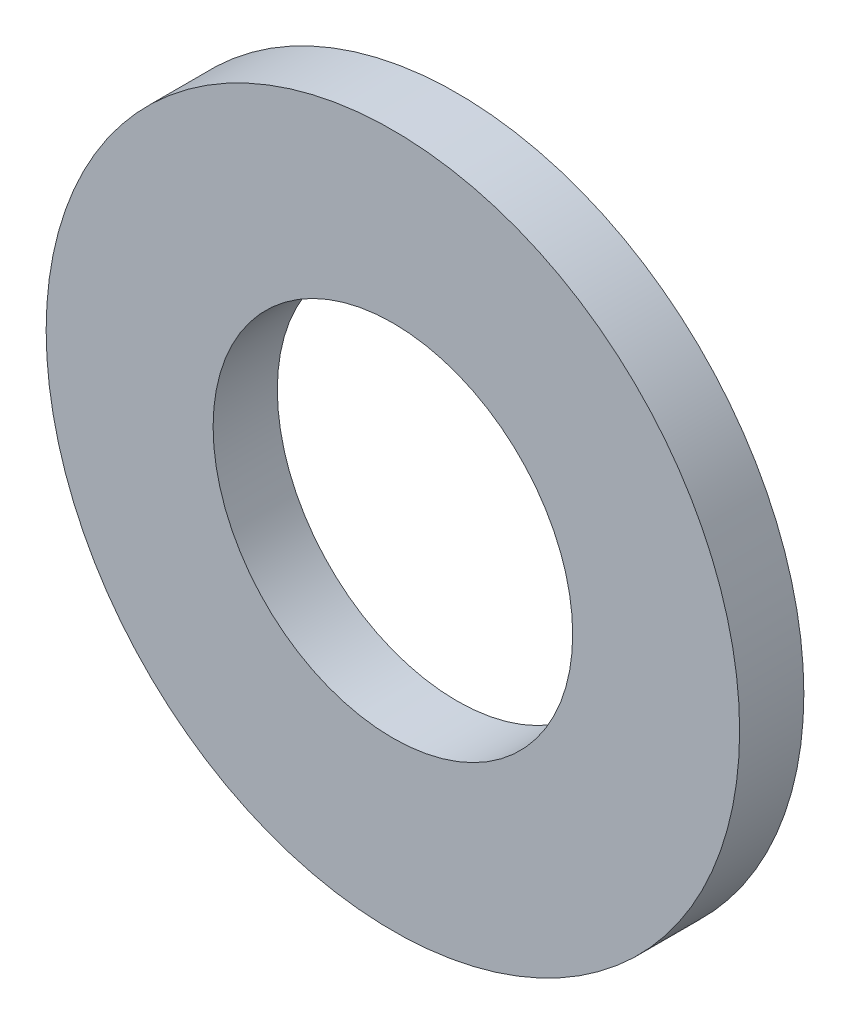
from build123d import *

# Parameters (mm, degrees)
ESQUISSE1_W = 6.5
ESQUISSE1_H = 2.5


with BuildPart() as part:
    # Esquisse1 → R_volution1 (revolve)
    with BuildSketch(Plane(origin=(0, 0, 0), x_dir=(1, 0, 0), z_dir=(0, 1, 0))):
        with Locations((10.25, -1.25)):
            Rectangle(ESQUISSE1_W, ESQUISSE1_H)
    revolve(axis=Axis((0, 0, 0), (0, 0, 1)))


solid = part.part
